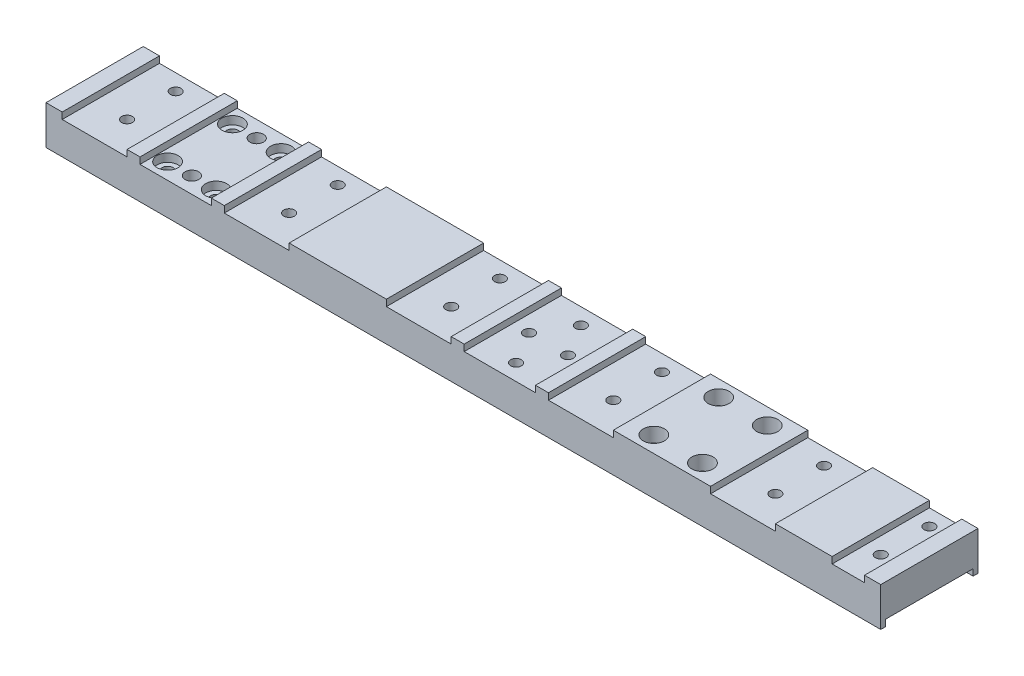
from build123d import *

# Parameters (mm, degrees)
EXTRUDE_1_DEPTH          = 30
CUT_EXTRUDE_1_DEPTH      = 260.519267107
CUT_EXTRUDE_1_DEPTH_BACK = 260.519267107
SKETCH_2_W               = 27
SKETCH_2_H               = 2
SKETCH_3_R               = 1.65
SKETCH_3_R_2             = 1.75
SKETCH_3_R_3             = 2.1
CUT_EXTRUDE_2_DEPTH      = 30
SKETCH_6_R               = 3.25
CUT_EXTRUDE_4_DEPTH      = 4.5


with BuildPart() as part:
    # Sketch 1 → Extrude 1 (new body)
    with BuildSketch(Plane.XY):
        Polygon((5, 10), (25, 10), (25, 12), (29, 12), (29, 10), (51, 10), (51, 12), (55, 12), (55, 10), (75, 10), (75, 12), (105, 12), (105, 10), (125, 10), (125, 12), (129, 12), (129, 10), (151, 10), (151, 12), (155, 12), (155, 10), (175, 10), (175, 12), (205, 12), (205, 10), (225, 10), (225, 12), (242.5, 12), (242.5, 10), (252.5, 10), (252.5, 12), (257.5, 12), (257.5, 0), (0, 0), (0, 12), (5, 12), align=None)
    extrude(amount=EXTRUDE_1_DEPTH)

    # Sketch 2 → Cut-Extrude 1 (cut, two sides: drawn at the far end of the back side and taken through both)
    with BuildSketch(Plane(origin=(257.5, 0, 0), x_dir=(0, 0, -1), z_dir=(1, 0, 0)).offset(-CUT_EXTRUDE_1_DEPTH_BACK)):
        with Locations((-15, 1)):
            Rectangle(SKETCH_2_W, SKETCH_2_H)
    extrude(amount=CUT_EXTRUDE_1_DEPTH + CUT_EXTRUDE_1_DEPTH_BACK, mode=Mode.SUBTRACT)

    # Sketch 3 → Cut-Extrude 2 (cut)
    with BuildSketch(Plane(origin=(0, 10, 0), x_dir=(1, 0, 0), z_dir=(0, 1, 0))):
        with Locations(Location((15, -5, 0), (0, 0, 270))):
            Circle(SKETCH_3_R)
        with Locations(Location((15, -20, 0), (0, 0, 270))):
            Circle(SKETCH_3_R)
        with Locations(Location((65, -5, 0), (0, 0, 270))):
            Circle(SKETCH_3_R)
        with Locations(Location((65, -20, 0), (0, 0, 270))):
            Circle(SKETCH_3_R)
        with Locations(Location((115, -20, 0), (0, 0, 270))):
            Circle(SKETCH_3_R)
        with Locations(Location((115, -5, 0), (0, 0, 270))):
            Circle(SKETCH_3_R)
        with Locations(Location((165, -5, 0), (0, 0, 270))):
            Circle(SKETCH_3_R)
        with Locations(Location((165, -20, 0), (0, 0, 270))):
            Circle(SKETCH_3_R)
        with Locations(Location((215, -5, 0), (0, 0, 270))):
            Circle(SKETCH_3_R)
        with Locations(Location((215, -20, 0), (0, 0, 270))):
            Circle(SKETCH_3_R)
        with Locations(Location((247.5, -20, 0), (0, 0, 270))):
            Circle(SKETCH_3_R)
        with Locations(Location((247.5, -5, 0), (0, 0, 270))):
            Circle(SKETCH_3_R)
        with Locations(Location((32.5, -5, 0), (0, 0, 270))):
            Circle(SKETCH_3_R_2)
        with Locations(Location((47.5, -5, 0), (0, 0, 270))):
            Circle(SKETCH_3_R_2)
        with Locations(Location((47.5, -25, 0), (0, 0, 270))):
            Circle(SKETCH_3_R_2)
        with Locations(Location((32.5, -25, 0), (0, 0, 270))):
            Circle(SKETCH_3_R_2)
        with Locations(Location((182.5, -5, 0), (0, 0, 270))):
            Circle(SKETCH_3_R_2)
        with Locations(Location((197.5, -5, 0), (0, 0, 270))):
            Circle(SKETCH_3_R_2)
        with Locations(Location((197.5, -25, 0), (0, 0, 270))):
            Circle(SKETCH_3_R_2)
        with Locations(Location((182.5, -25, 0), (0, 0, 270))):
            Circle(SKETCH_3_R_2)
        with Locations(Location((140, -5, 0), (0, 0, 270))):
            Circle(SKETCH_3_R)
        with Locations(Location((140, -25, 0), (0, 0, 270))):
            Circle(SKETCH_3_R)
        with Locations(Location((40, -5, 0), (0, 0, 270))):
            Circle(SKETCH_3_R_3)
        with Locations(Location((40, -25, 0), (0, 0, 270))):
            Circle(SKETCH_3_R_3)
        with Locations(Location((134, -15, 0), (0, 0, 270))):
            Circle(SKETCH_3_R)
        with Locations(Location((146, -15, 0), (0, 0, 270))):
            Circle(SKETCH_3_R)
    extrude(amount=-CUT_EXTRUDE_2_DEPTH, mode=Mode.SUBTRACT)

    # Sketch 6 → Cut-Extrude 4 (cut)
    with BuildSketch(Plane(origin=(0, 12, 0), x_dir=(1, 0, 0), z_dir=(0, 1, 0))):
        with Locations(Location((32.5, -5, 0), (0, 0, 270))):
            Circle(SKETCH_6_R)
        with Locations(Location((47.5, -5, 0), (0, 0, 270))):
            Circle(SKETCH_6_R)
        with Locations(Location((47.5, -25, 0), (0, 0, 270))):
            Circle(SKETCH_6_R)
        with Locations(Location((32.5, -25, 0), (0, 0, 270))):
            Circle(SKETCH_6_R)
        with Locations(Location((182.5, -5, 0), (0, 0, 270))):
            Circle(SKETCH_6_R)
        with Locations(Location((197.5, -5, 0), (0, 0, 270))):
            Circle(SKETCH_6_R)
        with Locations(Location((197.5, -25, 0), (0, 0, 270))):
            Circle(SKETCH_6_R)
        with Locations(Location((182.5, -25, 0), (0, 0, 270))):
            Circle(SKETCH_6_R)
    extrude(amount=-CUT_EXTRUDE_4_DEPTH, mode=Mode.SUBTRACT)


solid = part.part
